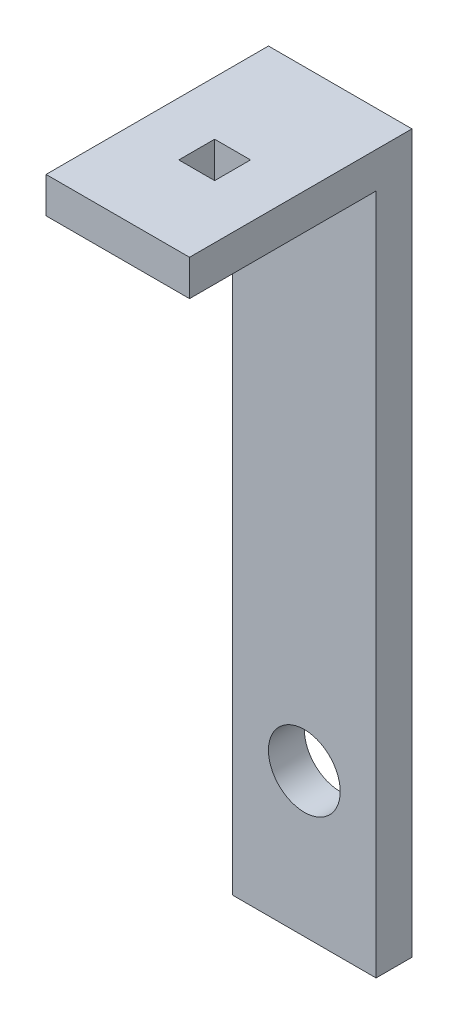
from build123d import *

# Parameters (mm, degrees)
BOSS_EXTRUDE1_DEPTH = 20
SKETCH3_R           = 5
CUT_EXTRUDE1_DEPTH  = 20
SKETCH4_W           = 5
SKETCH4_H           = 5
CUT_EXTRUDE2_DEPTH  = 15


with BuildPart() as part:
    # Sketch2 → Boss-Extrude1 (new body)
    with BuildSketch(Plane(origin=(0, 0, 0), x_dir=(0, 0, -1), z_dir=(1, 0, 0))):
        Polygon((0, 0), (-31, 0), (-31, -5), (-5, -5), (-5, -100), (0, -100), align=None)
    extrude(amount=BOSS_EXTRUDE1_DEPTH)

    # Sketch3 → Cut-Extrude1 (cut)
    with BuildSketch(Plane(origin=(0, 8.308152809, 5), x_dir=(1, 0, 0), z_dir=(0, 0, -1))):
        with Locations((10, 88.308152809)):
            Circle(SKETCH3_R)
    extrude(amount=CUT_EXTRUDE1_DEPTH, mode=Mode.SUBTRACT)

    # Sketch4 → Cut-Extrude2 (cut)
    with BuildSketch(Plane(origin=(0, -5, 24.160822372), x_dir=(1, 0, 0), z_dir=(0, 1, 0))):
        with Locations((10, 6.660822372)):
            Rectangle(SKETCH4_W, SKETCH4_H)
    extrude(amount=CUT_EXTRUDE2_DEPTH, mode=Mode.SUBTRACT)


solid = part.part
